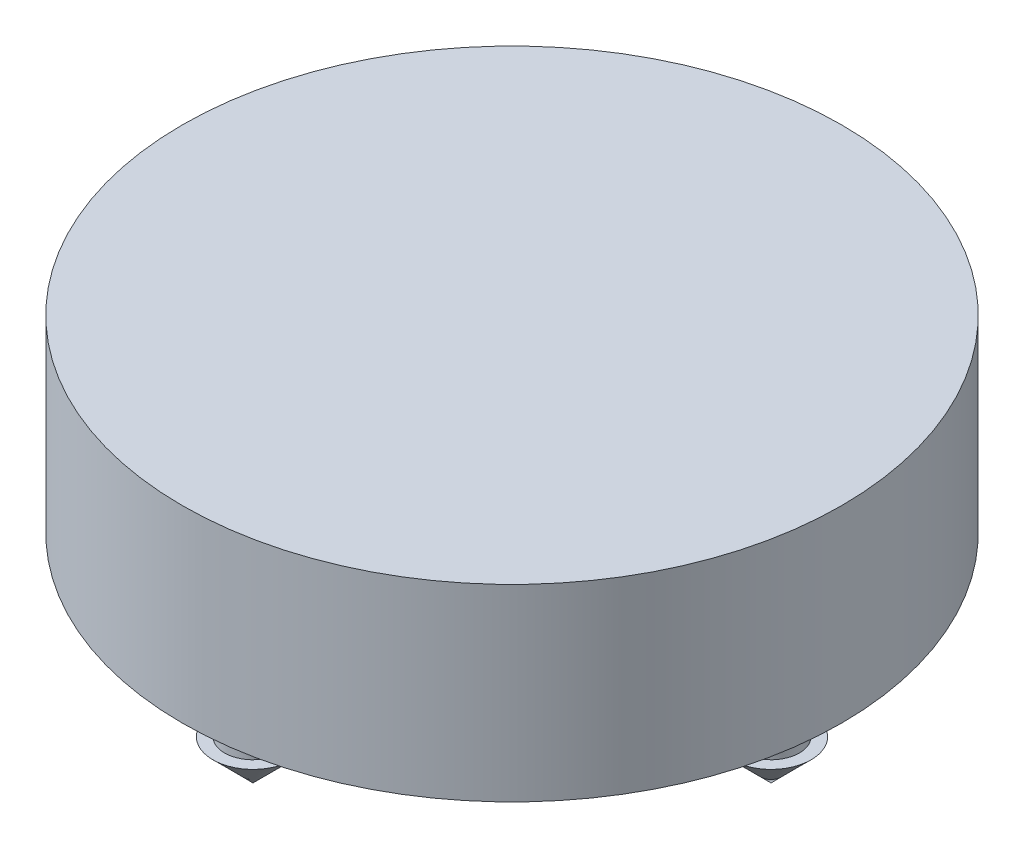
ISO-10303-21;
HEADER;
FILE_DESCRIPTION(('STEP AP214'),'2;1');
FILE_NAME('part.step','',(''),(''),'','','');
FILE_SCHEMA(('AUTOMOTIVE_DESIGN { 1 0 10303 214 1 1 1 1 }'));
ENDSEC;
DATA;
#1=APPLICATION_CONTEXT('core data for automotive mechanical design processes');
#2=APPLICATION_PROTOCOL_DEFINITION('international standard','automotive_design',2000,#1);
#3=PRODUCT_CONTEXT('',#1,'mechanical');
#4=PRODUCT('Part','Part','',(#3));
#5=PRODUCT_RELATED_PRODUCT_CATEGORY('part','',(#4));
#6=PRODUCT_DEFINITION_FORMATION('','',#4);
#7=PRODUCT_DEFINITION_CONTEXT('part definition',#1,'design');
#8=PRODUCT_DEFINITION('design','',#6,#7);
#9=PRODUCT_DEFINITION_SHAPE('','',#8);
#10=(LENGTH_UNIT() NAMED_UNIT(*) SI_UNIT(.MILLI.,.METRE.));
#11=(NAMED_UNIT(*) PLANE_ANGLE_UNIT() SI_UNIT($,.RADIAN.));
#12=(NAMED_UNIT(*) SI_UNIT($,.STERADIAN.) SOLID_ANGLE_UNIT());
#13=UNCERTAINTY_MEASURE_WITH_UNIT(LENGTH_MEASURE(1.E-05),#10,'distance_accuracy_value','');
#14=(GEOMETRIC_REPRESENTATION_CONTEXT(3) GLOBAL_UNCERTAINTY_ASSIGNED_CONTEXT((#13)) GLOBAL_UNIT_ASSIGNED_CONTEXT((#10,
#11,#12)) REPRESENTATION_CONTEXT('',''));
#15=CARTESIAN_POINT('',(0.,0.,0.));
#16=DIRECTION('',(0.,0.,1.));
#17=DIRECTION('',(1.,0.,0.));
#18=AXIS2_PLACEMENT_3D('',#15,#16,#17);
#19=CARTESIAN_POINT('',(0.,15.,0.));
#20=DIRECTION('',(0.,1.,0.));
#21=DIRECTION('',(1.,0.,0.));
#22=AXIS2_PLACEMENT_3D('',#19,#20,#21);
#23=CONICAL_SURFACE('',#22,10.,0.174532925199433);
#24=CARTESIAN_POINT('',(0.906469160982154,41.9074480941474,-14.7166185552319));
#25=CARTESIAN_POINT('',(0.906469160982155,39.8455454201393,-14.35235867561));
#26=CARTESIAN_POINT('',(0.906469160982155,37.7836509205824,-13.9880525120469));
#27=CARTESIAN_POINT('',(0.906469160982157,33.6598853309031,-13.2593146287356));
#28=CARTESIAN_POINT('',(0.906469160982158,31.5980142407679,-12.8948829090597));
#29=CARTESIAN_POINT('',(0.906469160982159,27.4743033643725,-12.1658610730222));
#30=CARTESIAN_POINT('',(0.90646916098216,25.4124635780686,-11.8012709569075));
#31=CARTESIAN_POINT('',(0.906469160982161,21.2888198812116,-11.0718811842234));
#32=CARTESIAN_POINT('',(0.906469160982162,19.2270159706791,-10.7070815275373));
#33=CARTESIAN_POINT('',(0.906469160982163,15.2028926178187,-9.99479978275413));
#34=CARTESIAN_POINT('',(0.906469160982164,13.2405708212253,-9.64733099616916));
#35=CARTESIAN_POINT('',(0.906469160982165,9.31598996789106,-8.95204237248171));
#36=CARTESIAN_POINT('',(0.906469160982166,7.35373091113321,-8.60422253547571));
#37=CARTESIAN_POINT('',(0.906469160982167,3.42930606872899,-7.90808240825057));
#38=CARTESIAN_POINT('',(0.906469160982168,1.46714028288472,-7.55976211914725));
#39=CARTESIAN_POINT('',(0.906469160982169,-2.45706127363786,-6.86237739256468));
#40=CARTESIAN_POINT('',(0.90646916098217,-4.41909704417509,-6.51331295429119));
#41=CARTESIAN_POINT('',(0.906469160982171,-7.36199860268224,-5.98881554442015));
#42=CARTESIAN_POINT('',(0.906469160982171,-8.34294452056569,-5.81383221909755));
#43=CARTESIAN_POINT('',(0.906469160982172,-10.3047653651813,-5.46346959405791));
#44=CARTESIAN_POINT('',(0.906469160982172,-11.2856402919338,-5.28809029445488));
#45=CARTESIAN_POINT('',(0.906469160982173,-13.2472920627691,-4.93680338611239));
#46=CARTESIAN_POINT('',(0.906469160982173,-14.228068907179,-4.7608957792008));
#47=CARTESIAN_POINT('',(0.906469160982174,-16.1894923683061,-4.40834966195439));
#48=CARTESIAN_POINT('',(0.906469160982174,-17.1701389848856,-4.23171115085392));
#49=CARTESIAN_POINT('',(0.906469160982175,-19.1312540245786,-3.87737726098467));
#50=CARTESIAN_POINT('',(0.906469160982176,-20.1117224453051,-3.69968186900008));
#51=CARTESIAN_POINT('',(0.906469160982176,-22.0723680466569,-3.34270401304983));
#52=CARTESIAN_POINT('',(0.906469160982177,-23.0525452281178,-3.16342155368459));
#53=CARTESIAN_POINT('',(0.906469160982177,-24.5224550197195,-2.89252624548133));
#54=CARTESIAN_POINT('',(0.906469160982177,-25.0123690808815,-2.80189855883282));
#55=CARTESIAN_POINT('',(0.906469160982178,-25.9920318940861,-2.61975749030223));
#56=CARTESIAN_POINT('',(0.906469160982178,-26.4817806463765,-2.52824410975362));
#57=CARTESIAN_POINT('',(0.906469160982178,-27.4610561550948,-2.34400712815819));
#58=CARTESIAN_POINT('',(0.906469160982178,-27.9505829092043,-2.2512835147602));
#59=CARTESIAN_POINT('',(0.906469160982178,-28.6846248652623,-2.11089309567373));
#60=CARTESIAN_POINT('',(0.906469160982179,-28.9292647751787,-2.06387866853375));
#61=CARTESIAN_POINT('',(0.906469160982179,-29.4184402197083,-1.96930804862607));
#62=CARTESIAN_POINT('',(0.906469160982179,-29.662975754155,-1.92175185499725));
#63=CARTESIAN_POINT('',(0.906469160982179,-29.9074480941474,-1.87387143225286));
#64=B_SPLINE_CURVE_WITH_KNOTS('',3,(#24,#25,#26,#27,#28,#29,#30,#31,#32,#33,#34,#35,#36,#37,#38,
#39,#40,#41,#42,#43,#44,#45,#46,#47,#48,#49,#50,#51,#52,#53,#54,#55,#56,#57,#58,#59,#60,#61,#62,
#63),.UNSPECIFIED.,.F.,.F.,(4,2,2,2,2,2,2,2,2,2,2,2,2,2,2,2,2,2,2,4),(0.,6.28149274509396,
12.5629818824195,18.8444612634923,25.1259441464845,31.1044868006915,37.0830278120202,
43.0615555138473,49.0400895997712,52.0293815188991,55.018672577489,58.0079533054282,
60.9972371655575,63.9865584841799,66.9758711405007,68.4705485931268,69.9652237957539,
71.4599142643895,72.2072632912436,72.9546135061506),.UNSPECIFIED.);
#65=CARTESIAN_POINT('',(0.906469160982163,15.,-9.95883093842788));
#66=VERTEX_POINT('',#65);
#67=CARTESIAN_POINT('',(0.90646916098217,-3.,-6.76565966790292));
#68=VERTEX_POINT('',#67);
#69=EDGE_CURVE('E204',#66,#68,#64,.T.);
#70=ORIENTED_EDGE('',*,*,#69,.F.);
#71=CARTESIAN_POINT('',(0.,15.,0.));
#72=DIRECTION('',(0.,-1.,0.));
#73=DIRECTION('',(1.,0.,0.));
#74=AXIS2_PLACEMENT_3D('',#71,#72,#73);
#75=CIRCLE('',#74,10.);
#76=CARTESIAN_POINT('',(0.906469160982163,15.,9.95883093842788));
#77=VERTEX_POINT('',#76);
#78=EDGE_CURVE('E227',#66,#77,#75,.T.);
#79=ORIENTED_EDGE('',*,*,#78,.T.);
#80=CARTESIAN_POINT('',(0.906469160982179,-29.9074480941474,1.87387143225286));
#81=CARTESIAN_POINT('',(0.906469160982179,-29.6173491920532,1.93068411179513));
#82=CARTESIAN_POINT('',(0.906469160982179,-29.3271624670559,1.98704558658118));
#83=CARTESIAN_POINT('',(0.906469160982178,-28.7466478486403,2.09903328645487));
#84=CARTESIAN_POINT('',(0.906469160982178,-28.4563199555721,2.15465951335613));
#85=CARTESIAN_POINT('',(0.906469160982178,-27.5851793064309,2.3206854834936));
#86=CARTESIAN_POINT('',(0.906469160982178,-27.0042043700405,2.43023353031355));
#87=CARTESIAN_POINT('',(0.906469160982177,-25.8419790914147,2.64783018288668));
#88=CARTESIAN_POINT('',(0.906469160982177,-25.2607287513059,2.75587880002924));
#89=CARTESIAN_POINT('',(0.906469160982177,-24.0980324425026,2.97091902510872));
#90=CARTESIAN_POINT('',(0.906469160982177,-23.5165864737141,3.07791063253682));
#91=CARTESIAN_POINT('',(0.906469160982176,-21.7720382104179,3.39774963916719));
#92=CARTESIAN_POINT('',(0.906469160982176,-20.60872775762,3.60946081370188));
#93=CARTESIAN_POINT('',(0.906469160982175,-18.2817617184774,4.03114817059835));
#94=CARTESIAN_POINT('',(0.906469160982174,-17.1181061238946,4.24112430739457));
#95=CARTESIAN_POINT('',(0.906469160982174,-14.790594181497,4.65995123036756));
#96=CARTESIAN_POINT('',(0.906469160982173,-13.6267378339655,4.86880201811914));
#97=CARTESIAN_POINT('',(0.906469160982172,-10.1979589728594,5.48295799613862));
#98=CARTESIAN_POINT('',(0.906469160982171,-7.93285126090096,5.88722865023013));
#99=CARTESIAN_POINT('',(0.90646916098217,-3.40237544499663,6.6943089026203));
#100=CARTESIAN_POINT('',(0.906469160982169,-1.13700734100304,7.09711850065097));
#101=CARTESIAN_POINT('',(0.906469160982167,3.39388885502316,7.90185277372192));
#102=CARTESIAN_POINT('',(0.906469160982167,5.65941694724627,8.3037774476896));
#103=CARTESIAN_POINT('',(0.906469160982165,10.190573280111,9.1070606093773));
#104=CARTESIAN_POINT('',(0.906469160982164,12.4562015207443,9.50841909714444));
#105=CARTESIAN_POINT('',(0.906469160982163,16.9872381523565,10.3106984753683));
#106=CARTESIAN_POINT('',(0.906469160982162,19.2526465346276,10.7116194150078));
#107=CARTESIAN_POINT('',(0.90646916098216,23.7835119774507,11.5131864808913));
#108=CARTESIAN_POINT('',(0.906469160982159,26.0489690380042,11.9138326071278));
#109=CARTESIAN_POINT('',(0.906469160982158,30.5799144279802,12.7149223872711));
#110=CARTESIAN_POINT('',(0.906469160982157,32.8454027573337,13.1153660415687));
#111=CARTESIAN_POINT('',(0.906469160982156,37.3764068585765,13.9160976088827));
#112=CARTESIAN_POINT('',(0.906469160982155,39.6419226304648,14.3163855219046));
#113=CARTESIAN_POINT('',(0.906469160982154,41.9074480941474,14.7166185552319));
#114=B_SPLINE_CURVE_WITH_KNOTS('',3,(#80,#81,#82,#83,#84,#85,#86,#87,#88,#89,#90,#91,#92,#93,
#94,#95,#96,#97,#98,#99,#100,#101,#102,#103,#104,#105,#106,#107,#108,#109,#110,#111,#112,#113),
.UNSPECIFIED.,.F.,.F.,(4,2,2,2,2,2,2,2,2,2,2,2,2,2,2,2,4),(0.,0.886827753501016,
1.77365331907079,3.54728852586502,5.3209102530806,7.09453283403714,10.6417847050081,
14.1891294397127,17.7364692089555,24.6391726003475,31.5418772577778,38.4445902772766,
45.3473027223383,52.2491368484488,59.1509711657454,66.0527921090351,72.9546128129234),.UNSPECIFIED.);
#115=CARTESIAN_POINT('',(0.90646916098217,-3.,6.76565966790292));
#116=VERTEX_POINT('',#115);
#117=EDGE_CURVE('E198',#116,#77,#114,.T.);
#118=ORIENTED_EDGE('',*,*,#117,.F.);
#119=CARTESIAN_POINT('',(0.,-3.,0.));
#120=DIRECTION('',(0.,-1.,0.));
#121=DIRECTION('',(1.,0.,0.));
#122=AXIS2_PLACEMENT_3D('',#119,#120,#121);
#123=CIRCLE('',#122,6.82611434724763);
#124=EDGE_CURVE('E231',#68,#116,#123,.T.);
#125=ORIENTED_EDGE('',*,*,#124,.F.);
#126=EDGE_LOOP('',(#70,#79,#118,#125));
#127=FACE_BOUND('',#126,.T.);
#128=ADVANCED_FACE('F39',(#127),#23,.T.);
#129=CARTESIAN_POINT('',(-0.906469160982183,41.9074480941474,14.7166185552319));
#130=CARTESIAN_POINT('',(-0.906469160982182,39.8455454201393,14.35235867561));
#131=CARTESIAN_POINT('',(-0.906469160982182,37.7836509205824,13.9880525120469));
#132=CARTESIAN_POINT('',(-0.90646916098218,33.6598853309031,13.2593146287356));
#133=CARTESIAN_POINT('',(-0.906469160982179,31.5980142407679,12.8948829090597));
#134=CARTESIAN_POINT('',(-0.906469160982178,27.4743033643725,12.1658610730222));
#135=CARTESIAN_POINT('',(-0.906469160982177,25.4124635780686,11.8012709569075));
#136=CARTESIAN_POINT('',(-0.906469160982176,21.2888198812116,11.0718811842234));
#137=CARTESIAN_POINT('',(-0.906469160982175,19.2270159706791,10.7070815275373));
#138=CARTESIAN_POINT('',(-0.906469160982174,15.2028926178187,9.99479978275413));
#139=CARTESIAN_POINT('',(-0.906469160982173,13.2405708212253,9.64733099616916));
#140=CARTESIAN_POINT('',(-0.906469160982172,9.31598996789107,8.95204237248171));
#141=CARTESIAN_POINT('',(-0.906469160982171,7.35373091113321,8.60422253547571));
#142=CARTESIAN_POINT('',(-0.90646916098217,3.42930606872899,7.90808240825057));
#143=CARTESIAN_POINT('',(-0.906469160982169,1.46714028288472,7.55976211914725));
#144=CARTESIAN_POINT('',(-0.906469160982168,-2.45706127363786,6.86237739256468));
#145=CARTESIAN_POINT('',(-0.906469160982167,-4.41909704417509,6.51331295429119));
#146=CARTESIAN_POINT('',(-0.906469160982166,-7.36199860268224,5.98881554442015));
#147=CARTESIAN_POINT('',(-0.906469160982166,-8.34294452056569,5.81383221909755));
#148=CARTESIAN_POINT('',(-0.906469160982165,-10.3047653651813,5.46346959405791));
#149=CARTESIAN_POINT('',(-0.906469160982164,-11.2856402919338,5.28809029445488));
#150=CARTESIAN_POINT('',(-0.906469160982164,-13.2472920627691,4.93680338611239));
#151=CARTESIAN_POINT('',(-0.906469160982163,-14.228068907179,4.7608957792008));
#152=CARTESIAN_POINT('',(-0.906469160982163,-16.1894923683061,4.40834966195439));
#153=CARTESIAN_POINT('',(-0.906469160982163,-17.1701389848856,4.23171115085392));
#154=CARTESIAN_POINT('',(-0.906469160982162,-19.1312540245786,3.87737726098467));
#155=CARTESIAN_POINT('',(-0.906469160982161,-20.1117224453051,3.69968186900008));
#156=CARTESIAN_POINT('',(-0.906469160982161,-22.0723680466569,3.34270401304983));
#157=CARTESIAN_POINT('',(-0.90646916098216,-23.0525452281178,3.16342155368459));
#158=CARTESIAN_POINT('',(-0.90646916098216,-24.5224550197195,2.89252624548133));
#159=CARTESIAN_POINT('',(-0.90646916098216,-25.0123690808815,2.80189855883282));
#160=CARTESIAN_POINT('',(-0.906469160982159,-25.9920318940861,2.61975749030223));
#161=CARTESIAN_POINT('',(-0.906469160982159,-26.4817806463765,2.52824410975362));
#162=CARTESIAN_POINT('',(-0.906469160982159,-27.4610561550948,2.34400712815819));
#163=CARTESIAN_POINT('',(-0.906469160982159,-27.9505829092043,2.2512835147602));
#164=CARTESIAN_POINT('',(-0.906469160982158,-28.6846248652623,2.11089309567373));
#165=CARTESIAN_POINT('',(-0.906469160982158,-28.9292647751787,2.06387866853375));
#166=CARTESIAN_POINT('',(-0.906469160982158,-29.4184402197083,1.96930804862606));
#167=CARTESIAN_POINT('',(-0.906469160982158,-29.662975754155,1.92175185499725));
#168=CARTESIAN_POINT('',(-0.906469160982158,-29.9074480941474,1.87387143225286));
#169=B_SPLINE_CURVE_WITH_KNOTS('',3,(#129,#130,#131,#132,#133,#134,#135,#136,#137,#138,#139,
#140,#141,#142,#143,#144,#145,#146,#147,#148,#149,#150,#151,#152,#153,#154,#155,#156,#157,#158,
#159,#160,#161,#162,#163,#164,#165,#166,#167,#168),.UNSPECIFIED.,.F.,.F.,(4,2,2,2,2,2,2,2,2,2,2,
2,2,2,2,2,2,2,2,4),(0.,6.28149274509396,12.5629818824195,18.8444612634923,25.1259441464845,
31.1044868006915,37.0830278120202,43.0615555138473,49.0400895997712,52.0293815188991,
55.018672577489,58.0079533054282,60.9972371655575,63.9865584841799,66.9758711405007,
68.4705485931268,69.965223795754,71.4599142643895,72.2072632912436,72.9546135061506),.UNSPECIFIED.);
#170=CARTESIAN_POINT('',(-0.906469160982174,15.,9.95883093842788));
#171=VERTEX_POINT('',#170);
#172=CARTESIAN_POINT('',(-0.906469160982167,-3.,6.76565966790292));
#173=VERTEX_POINT('',#172);
#174=EDGE_CURVE('E54',#171,#173,#169,.T.);
#175=ORIENTED_EDGE('',*,*,#174,.F.);
#176=CARTESIAN_POINT('',(-0.906469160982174,15.,-9.95883093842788));
#177=VERTEX_POINT('',#176);
#178=EDGE_CURVE('E230',#171,#177,#75,.T.);
#179=ORIENTED_EDGE('',*,*,#178,.T.);
#180=CARTESIAN_POINT('',(-0.906469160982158,-29.9074480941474,-1.87387143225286));
#181=CARTESIAN_POINT('',(-0.906469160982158,-29.6173491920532,-1.93068411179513));
#182=CARTESIAN_POINT('',(-0.906469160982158,-29.3271624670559,-1.98704558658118));
#183=CARTESIAN_POINT('',(-0.906469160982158,-28.7466478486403,-2.09903328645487));
#184=CARTESIAN_POINT('',(-0.906469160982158,-28.4563199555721,-2.15465951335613));
#185=CARTESIAN_POINT('',(-0.906469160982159,-27.5851793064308,-2.3206854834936));
#186=CARTESIAN_POINT('',(-0.906469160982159,-27.0042043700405,-2.43023353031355));
#187=CARTESIAN_POINT('',(-0.906469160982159,-25.8419790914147,-2.64783018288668));
#188=CARTESIAN_POINT('',(-0.90646916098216,-25.2607287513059,-2.75587880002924));
#189=CARTESIAN_POINT('',(-0.90646916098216,-24.0980324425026,-2.97091902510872));
#190=CARTESIAN_POINT('',(-0.90646916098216,-23.5165864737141,-3.07791063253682));
#191=CARTESIAN_POINT('',(-0.906469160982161,-21.7720382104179,-3.39774963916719));
#192=CARTESIAN_POINT('',(-0.906469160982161,-20.60872775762,-3.60946081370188));
#193=CARTESIAN_POINT('',(-0.906469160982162,-18.2817617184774,-4.03114817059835));
#194=CARTESIAN_POINT('',(-0.906469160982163,-17.1181061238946,-4.24112430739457));
#195=CARTESIAN_POINT('',(-0.906469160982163,-14.790594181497,-4.65995123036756));
#196=CARTESIAN_POINT('',(-0.906469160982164,-13.6267378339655,-4.86880201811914));
#197=CARTESIAN_POINT('',(-0.906469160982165,-10.1979589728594,-5.48295799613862));
#198=CARTESIAN_POINT('',(-0.906469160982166,-7.93285126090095,-5.88722865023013));
#199=CARTESIAN_POINT('',(-0.906469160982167,-3.40237544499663,-6.69430890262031));
#200=CARTESIAN_POINT('',(-0.906469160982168,-1.13700734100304,-7.09711850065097));
#201=CARTESIAN_POINT('',(-0.90646916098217,3.39388885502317,-7.90185277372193));
#202=CARTESIAN_POINT('',(-0.90646916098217,5.65941694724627,-8.3037774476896));
#203=CARTESIAN_POINT('',(-0.906469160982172,10.190573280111,-9.1070606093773));
#204=CARTESIAN_POINT('',(-0.906469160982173,12.4562015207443,-9.50841909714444));
#205=CARTESIAN_POINT('',(-0.906469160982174,16.9872381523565,-10.3106984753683));
#206=CARTESIAN_POINT('',(-0.906469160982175,19.2526465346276,-10.7116194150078));
#207=CARTESIAN_POINT('',(-0.906469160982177,23.7835119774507,-11.5131864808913));
#208=CARTESIAN_POINT('',(-0.906469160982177,26.0489690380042,-11.9138326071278));
#209=CARTESIAN_POINT('',(-0.906469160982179,30.5799144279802,-12.714922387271));
#210=CARTESIAN_POINT('',(-0.90646916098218,32.8454027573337,-13.1153660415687));
#211=CARTESIAN_POINT('',(-0.906469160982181,37.3764068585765,-13.9160976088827));
#212=CARTESIAN_POINT('',(-0.906469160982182,39.6419226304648,-14.3163855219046));
#213=CARTESIAN_POINT('',(-0.906469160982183,41.9074480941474,-14.7166185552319));
#214=B_SPLINE_CURVE_WITH_KNOTS('',3,(#180,#181,#182,#183,#184,#185,#186,#187,#188,#189,#190,
#191,#192,#193,#194,#195,#196,#197,#198,#199,#200,#201,#202,#203,#204,#205,#206,#207,#208,#209,
#210,#211,#212,#213),.UNSPECIFIED.,.F.,.F.,(4,2,2,2,2,2,2,2,2,2,2,2,2,2,2,2,4),(0.,
0.886827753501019,1.7736533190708,3.54728852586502,5.3209102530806,7.09453283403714,
10.6417847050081,14.1891294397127,17.7364692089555,24.6391726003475,31.5418772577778,
38.4445902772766,45.3473027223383,52.2491368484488,59.1509711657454,66.052792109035,
72.9546128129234),.UNSPECIFIED.);
#215=CARTESIAN_POINT('',(-0.906469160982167,-3.,-6.76565966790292));
#216=VERTEX_POINT('',#215);
#217=EDGE_CURVE('E165',#216,#177,#214,.T.);
#218=ORIENTED_EDGE('',*,*,#217,.F.);
#219=EDGE_CURVE('E234',#173,#216,#123,.T.);
#220=ORIENTED_EDGE('',*,*,#219,.F.);
#221=EDGE_LOOP('',(#175,#179,#218,#220));
#222=FACE_BOUND('',#221,.T.);
#223=ADVANCED_FACE('F261',(#222),#23,.T.);
#224=CARTESIAN_POINT('',(0.,-3.,0.));
#225=DIRECTION('',(0.,-1.,0.));
#226=DIRECTION('',(1.,0.,0.));
#227=AXIS2_PLACEMENT_3D('',#224,#225,#226);
#228=PLANE('',#227);
#229=ORIENTED_EDGE('',*,*,#124,.T.);
#230=DIRECTION('',(0.,0.,-1.));
#231=VECTOR('',#230,1.);
#232=CARTESIAN_POINT('',(0.90646916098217,-3.,0.));
#233=LINE('',#232,#231);
#234=EDGE_CURVE('E11',#116,#68,#233,.T.);
#235=ORIENTED_EDGE('',*,*,#234,.T.);
#236=EDGE_LOOP('',(#229,#235));
#237=FACE_BOUND('',#236,.T.);
#238=ADVANCED_FACE('F290',(#237),#228,.T.);
#239=ORIENTED_EDGE('',*,*,#219,.T.);
#240=DIRECTION('',(0.,0.,1.));
#241=VECTOR('',#240,1.);
#242=CARTESIAN_POINT('',(-0.906469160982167,-3.,0.));
#243=LINE('',#242,#241);
#244=EDGE_CURVE('E47',#216,#173,#243,.T.);
#245=ORIENTED_EDGE('',*,*,#244,.T.);
#246=EDGE_LOOP('',(#239,#245));
#247=FACE_BOUND('',#246,.T.);
#248=ADVANCED_FACE('F258',(#247),#228,.T.);
#249=CARTESIAN_POINT('',(0.,20.,0.));
#250=DIRECTION('',(0.,1.,0.));
#251=DIRECTION('',(-1.,0.,0.));
#252=AXIS2_PLACEMENT_3D('',#249,#250,#251);
#253=PLANE('',#252);
#254=CARTESIAN_POINT('',(0.,20.,0.));
#255=DIRECTION('',(0.,-1.,0.));
#256=DIRECTION('',(1.,0.,0.));
#257=AXIS2_PLACEMENT_3D('',#254,#255,#256);
#258=CIRCLE('',#257,35.);
#259=CARTESIAN_POINT('',(35.,20.,0.));
#260=VERTEX_POINT('',#259);
#261=EDGE_CURVE('E244',#260,#260,#258,.T.);
#262=ORIENTED_EDGE('',*,*,#261,.F.);
#263=EDGE_LOOP('',(#262));
#264=FACE_BOUND('',#263,.T.);
#265=ADVANCED_FACE('F41',(#264),#253,.T.);
#266=CARTESIAN_POINT('',(0.,0.,0.));
#267=DIRECTION('',(0.,-1.,0.));
#268=DIRECTION('',(1.,0.,0.));
#269=AXIS2_PLACEMENT_3D('',#266,#267,#268);
#270=CYLINDRICAL_SURFACE('',#269,35.);
#271=DIRECTION('',(0.,-1.,0.));
#272=VECTOR('',#271,1.);
#273=CARTESIAN_POINT('',(3.5,0.,-34.8245602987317));
#274=LINE('',#273,#272);
#275=CARTESIAN_POINT('',(3.5,12.6432003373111,-34.8245602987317));
#276=VERTEX_POINT('',#275);
#277=CARTESIAN_POINT('',(3.5,8.64320033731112,-34.8245602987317));
#278=VERTEX_POINT('',#277);
#279=EDGE_CURVE('E225',#276,#278,#274,.T.);
#280=ORIENTED_EDGE('',*,*,#279,.F.);
#281=CARTESIAN_POINT('',(0.,12.6432003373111,0.));
#282=DIRECTION('',(0.,1.,0.));
#283=DIRECTION('',(0.,0.,1.));
#284=AXIS2_PLACEMENT_3D('',#281,#282,#283);
#285=CIRCLE('',#284,35.);
#286=CARTESIAN_POINT('',(-3.5,12.6432003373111,-34.8245602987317));
#287=VERTEX_POINT('',#286);
#288=EDGE_CURVE('E214',#287,#276,#285,.F.);
#289=ORIENTED_EDGE('',*,*,#288,.F.);
#290=DIRECTION('',(0.,-1.,0.));
#291=VECTOR('',#290,1.);
#292=CARTESIAN_POINT('',(-3.5,0.,-34.8245602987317));
#293=LINE('',#292,#291);
#294=CARTESIAN_POINT('',(-3.5,8.64320033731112,-34.8245602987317));
#295=VERTEX_POINT('',#294);
#296=EDGE_CURVE('E221',#295,#287,#293,.F.);
#297=ORIENTED_EDGE('',*,*,#296,.F.);
#298=CARTESIAN_POINT('',(0.,8.64320033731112,0.));
#299=DIRECTION('',(0.,-1.,0.));
#300=DIRECTION('',(0.,0.,-1.));
#301=AXIS2_PLACEMENT_3D('',#298,#299,#300);
#302=CIRCLE('',#301,35.);
#303=EDGE_CURVE('E223',#278,#295,#302,.F.);
#304=ORIENTED_EDGE('',*,*,#303,.F.);
#305=EDGE_LOOP('',(#280,#289,#297,#304));
#306=FACE_BOUND('',#305,.T.);
#307=ORIENTED_EDGE('',*,*,#261,.T.);
#308=EDGE_LOOP('',(#307));
#309=FACE_BOUND('',#308,.T.);
#310=CARTESIAN_POINT('',(0.,0.,0.));
#311=DIRECTION('',(0.,-1.,0.));
#312=DIRECTION('',(1.,0.,0.));
#313=AXIS2_PLACEMENT_3D('',#310,#311,#312);
#314=CIRCLE('',#313,35.);
#315=CARTESIAN_POINT('',(35.,0.,0.));
#316=VERTEX_POINT('',#315);
#317=EDGE_CURVE('E241',#316,#316,#314,.T.);
#318=ORIENTED_EDGE('',*,*,#317,.F.);
#319=EDGE_LOOP('',(#318));
#320=FACE_BOUND('',#319,.T.);
#321=ADVANCED_FACE('F280',(#306,#309,#320),#270,.T.);
#322=CARTESIAN_POINT('',(35.,0.,0.));
#323=DIRECTION('',(0.,-1.,0.));
#324=DIRECTION('',(1.,0.,0.));
#325=AXIS2_PLACEMENT_3D('',#322,#323,#324);
#326=PLANE('',#325);
#327=CARTESIAN_POINT('',(2.88047210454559E-13,0.,-27.5));
#328=DIRECTION('',(0.,-1.,0.));
#329=DIRECTION('',(0.,0.,-1.));
#330=AXIS2_PLACEMENT_3D('',#327,#328,#329);
#331=CIRCLE('',#330,3.);
#332=CARTESIAN_POINT('',(3.19470542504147E-13,0.,-30.5));
#333=VERTEX_POINT('',#332);
#334=EDGE_CURVE('E135',#333,#333,#331,.T.);
#335=ORIENTED_EDGE('',*,*,#334,.F.);
#336=EDGE_LOOP('',(#335));
#337=FACE_BOUND('',#336,.T.);
#338=CARTESIAN_POINT('',(-27.5,0.,0.));
#339=DIRECTION('',(0.,-1.,0.));
#340=DIRECTION('',(-1.,0.,0.));
#341=AXIS2_PLACEMENT_3D('',#338,#339,#340);
#342=CIRCLE('',#341,3.);
#343=CARTESIAN_POINT('',(-30.5,0.,0.));
#344=VERTEX_POINT('',#343);
#345=EDGE_CURVE('E139',#344,#344,#342,.T.);
#346=ORIENTED_EDGE('',*,*,#345,.F.);
#347=EDGE_LOOP('',(#346));
#348=FACE_BOUND('',#347,.T.);
#349=CARTESIAN_POINT('',(0.,0.,27.5));
#350=DIRECTION('',(0.,-1.,0.));
#351=DIRECTION('',(0.,0.,1.));
#352=AXIS2_PLACEMENT_3D('',#349,#350,#351);
#353=CIRCLE('',#352,3.);
#354=CARTESIAN_POINT('',(-1.06490180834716E-13,0.,30.5));
#355=VERTEX_POINT('',#354);
#356=EDGE_CURVE('E145',#355,#355,#353,.T.);
#357=ORIENTED_EDGE('',*,*,#356,.F.);
#358=EDGE_LOOP('',(#357));
#359=FACE_BOUND('',#358,.T.);
#360=CARTESIAN_POINT('',(27.5,0.,0.));
#361=DIRECTION('',(0.,-1.,0.));
#362=DIRECTION('',(1.,0.,0.));
#363=AXIS2_PLACEMENT_3D('',#360,#361,#362);
#364=CIRCLE('',#363,3.);
#365=CARTESIAN_POINT('',(30.5,0.,0.));
#366=VERTEX_POINT('',#365);
#367=EDGE_CURVE('E151',#366,#366,#364,.T.);
#368=ORIENTED_EDGE('',*,*,#367,.F.);
#369=EDGE_LOOP('',(#368));
#370=FACE_BOUND('',#369,.T.);
#371=ORIENTED_EDGE('',*,*,#317,.T.);
#372=EDGE_LOOP('',(#371));
#373=FACE_BOUND('',#372,.T.);
#374=CARTESIAN_POINT('',(0.,0.,0.));
#375=DIRECTION('',(0.,-1.,0.));
#376=DIRECTION('',(1.,0.,0.));
#377=AXIS2_PLACEMENT_3D('',#374,#375,#376);
#378=CIRCLE('',#377,20.);
#379=CARTESIAN_POINT('',(20.,0.,0.));
#380=VERTEX_POINT('',#379);
#381=EDGE_CURVE('E238',#380,#380,#378,.T.);
#382=ORIENTED_EDGE('',*,*,#381,.F.);
#383=EDGE_LOOP('',(#382));
#384=FACE_BOUND('',#383,.T.);
#385=ADVANCED_FACE('F274',(#337,#348,#359,#370,#373,#384),#326,.T.);
#386=CARTESIAN_POINT('',(0.,0.,0.));
#387=DIRECTION('',(0.,-1.,0.));
#388=DIRECTION('',(1.,0.,0.));
#389=AXIS2_PLACEMENT_3D('',#386,#387,#388);
#390=CYLINDRICAL_SURFACE('',#389,20.);
#391=DIRECTION('',(0.,-1.,0.));
#392=VECTOR('',#391,1.);
#393=CARTESIAN_POINT('',(3.5,0.,-19.6913686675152));
#394=LINE('',#393,#392);
#395=CARTESIAN_POINT('',(3.5,8.64320033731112,-19.6913686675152));
#396=VERTEX_POINT('',#395);
#397=CARTESIAN_POINT('',(3.5,12.6432003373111,-19.6913686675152));
#398=VERTEX_POINT('',#397);
#399=EDGE_CURVE('E253',#396,#398,#394,.F.);
#400=ORIENTED_EDGE('',*,*,#399,.F.);
#401=CARTESIAN_POINT('',(0.,8.64320033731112,0.));
#402=DIRECTION('',(0.,-1.,0.));
#403=DIRECTION('',(0.,0.,-1.));
#404=AXIS2_PLACEMENT_3D('',#401,#402,#403);
#405=CIRCLE('',#404,20.);
#406=CARTESIAN_POINT('',(-3.5,8.64320033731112,-19.6913686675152));
#407=VERTEX_POINT('',#406);
#408=EDGE_CURVE('E251',#407,#396,#405,.T.);
#409=ORIENTED_EDGE('',*,*,#408,.F.);
#410=DIRECTION('',(0.,-1.,0.));
#411=VECTOR('',#410,1.);
#412=CARTESIAN_POINT('',(-3.5,0.,-19.6913686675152));
#413=LINE('',#412,#411);
#414=CARTESIAN_POINT('',(-3.5,12.6432003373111,-19.6913686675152));
#415=VERTEX_POINT('',#414);
#416=EDGE_CURVE('E249',#415,#407,#413,.T.);
#417=ORIENTED_EDGE('',*,*,#416,.F.);
#418=CARTESIAN_POINT('',(0.,12.6432003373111,0.));
#419=DIRECTION('',(0.,1.,0.));
#420=DIRECTION('',(0.,0.,1.));
#421=AXIS2_PLACEMENT_3D('',#418,#419,#420);
#422=CIRCLE('',#421,20.);
#423=EDGE_CURVE('E247',#398,#415,#422,.T.);
#424=ORIENTED_EDGE('',*,*,#423,.F.);
#425=EDGE_LOOP('',(#400,#409,#417,#424));
#426=FACE_BOUND('',#425,.T.);
#427=ORIENTED_EDGE('',*,*,#381,.T.);
#428=EDGE_LOOP('',(#427));
#429=FACE_BOUND('',#428,.T.);
#430=CARTESIAN_POINT('',(0.,15.,0.));
#431=DIRECTION('',(0.,-1.,0.));
#432=DIRECTION('',(1.,0.,0.));
#433=AXIS2_PLACEMENT_3D('',#430,#431,#432);
#434=CIRCLE('',#433,20.);
#435=CARTESIAN_POINT('',(20.,15.,0.));
#436=VERTEX_POINT('',#435);
#437=EDGE_CURVE('E235',#436,#436,#434,.T.);
#438=ORIENTED_EDGE('',*,*,#437,.F.);
#439=EDGE_LOOP('',(#438));
#440=FACE_BOUND('',#439,.T.);
#441=ADVANCED_FACE('F269',(#426,#429,#440),#390,.F.);
#442=CARTESIAN_POINT('',(20.,15.,0.));
#443=DIRECTION('',(0.,-1.,0.));
#444=DIRECTION('',(1.,0.,0.));
#445=AXIS2_PLACEMENT_3D('',#442,#443,#444);
#446=PLANE('',#445);
#447=DIRECTION('',(0.,0.,1.));
#448=VECTOR('',#447,1.);
#449=CARTESIAN_POINT('',(0.906469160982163,15.,16.5604942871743));
#450=LINE('',#449,#448);
#451=EDGE_CURVE('E157',#66,#77,#450,.T.);
#452=ORIENTED_EDGE('',*,*,#451,.T.);
#453=ORIENTED_EDGE('',*,*,#78,.F.);
#454=EDGE_LOOP('',(#452,#453));
#455=FACE_BOUND('',#454,.T.);
#456=DIRECTION('',(0.,0.,-1.));
#457=VECTOR('',#456,1.);
#458=CARTESIAN_POINT('',(-0.906469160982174,15.,16.5604942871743));
#459=LINE('',#458,#457);
#460=EDGE_CURVE('E162',#171,#177,#459,.T.);
#461=ORIENTED_EDGE('',*,*,#460,.T.);
#462=ORIENTED_EDGE('',*,*,#178,.F.);
#463=EDGE_LOOP('',(#461,#462));
#464=FACE_BOUND('',#463,.T.);
#465=ORIENTED_EDGE('',*,*,#437,.T.);
#466=EDGE_LOOP('',(#465));
#467=FACE_BOUND('',#466,.T.);
#468=ADVANCED_FACE('F265',(#455,#464,#467),#446,.T.);
#469=CARTESIAN_POINT('',(3.5,12.6432003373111,-46.));
#470=DIRECTION('',(1.,0.,0.));
#471=DIRECTION('',(0.,0.,-1.));
#472=AXIS2_PLACEMENT_3D('',#469,#470,#471);
#473=PLANE('',#472);
#474=ORIENTED_EDGE('',*,*,#279,.T.);
#475=DIRECTION('',(0.,0.,1.));
#476=VECTOR('',#475,1.);
#477=CARTESIAN_POINT('',(3.5,8.64320033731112,-46.));
#478=LINE('',#477,#476);
#479=EDGE_CURVE('E211',#278,#396,#478,.T.);
#480=ORIENTED_EDGE('',*,*,#479,.T.);
#481=ORIENTED_EDGE('',*,*,#399,.T.);
#482=DIRECTION('',(0.,0.,1.));
#483=VECTOR('',#482,1.);
#484=CARTESIAN_POINT('',(3.5,12.6432003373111,-46.));
#485=LINE('',#484,#483);
#486=EDGE_CURVE('E210',#276,#398,#485,.T.);
#487=ORIENTED_EDGE('',*,*,#486,.F.);
#488=EDGE_LOOP('',(#474,#480,#481,#487));
#489=FACE_BOUND('',#488,.T.);
#490=ADVANCED_FACE('F268',(#489),#473,.F.);
#491=CARTESIAN_POINT('',(-3.5,8.64320033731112,-46.));
#492=DIRECTION('',(0.,-1.,0.));
#493=DIRECTION('',(0.,0.,-1.));
#494=AXIS2_PLACEMENT_3D('',#491,#492,#493);
#495=PLANE('',#494);
#496=ORIENTED_EDGE('',*,*,#303,.T.);
#497=DIRECTION('',(0.,0.,1.));
#498=VECTOR('',#497,1.);
#499=CARTESIAN_POINT('',(-3.5,8.64320033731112,-46.));
#500=LINE('',#499,#498);
#501=EDGE_CURVE('E215',#295,#407,#500,.T.);
#502=ORIENTED_EDGE('',*,*,#501,.T.);
#503=ORIENTED_EDGE('',*,*,#408,.T.);
#504=ORIENTED_EDGE('',*,*,#479,.F.);
#505=EDGE_LOOP('',(#496,#502,#503,#504));
#506=FACE_BOUND('',#505,.T.);
#507=ADVANCED_FACE('F195',(#506),#495,.F.);
#508=CARTESIAN_POINT('',(-3.5,12.6432003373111,-46.));
#509=DIRECTION('',(-1.,0.,0.));
#510=DIRECTION('',(0.,-1.,0.));
#511=AXIS2_PLACEMENT_3D('',#508,#509,#510);
#512=PLANE('',#511);
#513=ORIENTED_EDGE('',*,*,#296,.T.);
#514=DIRECTION('',(0.,0.,1.));
#515=VECTOR('',#514,1.);
#516=CARTESIAN_POINT('',(-3.5,12.6432003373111,-46.));
#517=LINE('',#516,#515);
#518=EDGE_CURVE('E62',#287,#415,#517,.T.);
#519=ORIENTED_EDGE('',*,*,#518,.T.);
#520=ORIENTED_EDGE('',*,*,#416,.T.);
#521=ORIENTED_EDGE('',*,*,#501,.F.);
#522=EDGE_LOOP('',(#513,#519,#520,#521));
#523=FACE_BOUND('',#522,.T.);
#524=ADVANCED_FACE('F305',(#523),#512,.F.);
#525=CARTESIAN_POINT('',(-3.5,12.6432003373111,-46.));
#526=DIRECTION('',(0.,1.,0.));
#527=DIRECTION('',(0.,0.,1.));
#528=AXIS2_PLACEMENT_3D('',#525,#526,#527);
#529=PLANE('',#528);
#530=ORIENTED_EDGE('',*,*,#288,.T.);
#531=ORIENTED_EDGE('',*,*,#486,.T.);
#532=ORIENTED_EDGE('',*,*,#423,.T.);
#533=ORIENTED_EDGE('',*,*,#518,.F.);
#534=EDGE_LOOP('',(#530,#531,#532,#533));
#535=FACE_BOUND('',#534,.T.);
#536=ADVANCED_FACE('F193',(#535),#529,.F.);
#537=CARTESIAN_POINT('',(0.90646916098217,-3.,16.5604942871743));
#538=DIRECTION('',(-1.,0.,0.));
#539=DIRECTION('',(0.,-1.,0.));
#540=AXIS2_PLACEMENT_3D('',#537,#538,#539);
#541=PLANE('',#540);
#542=ORIENTED_EDGE('',*,*,#69,.T.);
#543=ORIENTED_EDGE('',*,*,#234,.F.);
#544=ORIENTED_EDGE('',*,*,#117,.T.);
#545=ORIENTED_EDGE('',*,*,#451,.F.);
#546=EDGE_LOOP('',(#542,#543,#544,#545));
#547=FACE_BOUND('',#546,.T.);
#548=ADVANCED_FACE('F187',(#547),#541,.T.);
#549=CARTESIAN_POINT('',(-0.906469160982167,-3.,16.5604942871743));
#550=DIRECTION('',(1.,0.,0.));
#551=DIRECTION('',(0.,1.,0.));
#552=AXIS2_PLACEMENT_3D('',#549,#550,#551);
#553=PLANE('',#552);
#554=ORIENTED_EDGE('',*,*,#174,.T.);
#555=ORIENTED_EDGE('',*,*,#244,.F.);
#556=ORIENTED_EDGE('',*,*,#217,.T.);
#557=ORIENTED_EDGE('',*,*,#460,.F.);
#558=EDGE_LOOP('',(#554,#555,#556,#557));
#559=FACE_BOUND('',#558,.T.);
#560=ADVANCED_FACE('F181',(#559),#553,.T.);
#561=CARTESIAN_POINT('',(27.5,-4.99999999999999,0.));
#562=DIRECTION('',(0.,1.,0.));
#563=DIRECTION('',(-1.,0.,0.));
#564=AXIS2_PLACEMENT_3D('',#561,#562,#563);
#565=CYLINDRICAL_SURFACE('',#564,3.);
#566=CARTESIAN_POINT('',(27.5,-4.99999999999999,0.));
#567=DIRECTION('',(0.,-1.,0.));
#568=DIRECTION('',(1.,0.,0.));
#569=AXIS2_PLACEMENT_3D('',#566,#567,#568);
#570=CIRCLE('',#569,3.);
#571=CARTESIAN_POINT('',(30.5,-4.99999999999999,0.));
#572=VERTEX_POINT('',#571);
#573=EDGE_CURVE('E154',#572,#572,#570,.T.);
#574=ORIENTED_EDGE('',*,*,#573,.F.);
#575=EDGE_LOOP('',(#574));
#576=FACE_BOUND('',#575,.T.);
#577=ORIENTED_EDGE('',*,*,#367,.T.);
#578=EDGE_LOOP('',(#577));
#579=FACE_BOUND('',#578,.T.);
#580=ADVANCED_FACE('F186',(#576,#579),#565,.T.);
#581=CARTESIAN_POINT('',(0.,-5.,27.5));
#582=DIRECTION('',(0.,1.,0.));
#583=DIRECTION('',(-1.,0.,0.));
#584=AXIS2_PLACEMENT_3D('',#581,#582,#583);
#585=CYLINDRICAL_SURFACE('',#584,3.);
#586=CARTESIAN_POINT('',(0.,-5.,27.5));
#587=DIRECTION('',(0.,-1.,0.));
#588=DIRECTION('',(0.,0.,1.));
#589=AXIS2_PLACEMENT_3D('',#586,#587,#588);
#590=CIRCLE('',#589,3.);
#591=CARTESIAN_POINT('',(-1.04755457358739E-13,-5.,30.5));
#592=VERTEX_POINT('',#591);
#593=EDGE_CURVE('E148',#592,#592,#590,.T.);
#594=ORIENTED_EDGE('',*,*,#593,.F.);
#595=EDGE_LOOP('',(#594));
#596=FACE_BOUND('',#595,.T.);
#597=ORIENTED_EDGE('',*,*,#356,.T.);
#598=EDGE_LOOP('',(#597));
#599=FACE_BOUND('',#598,.T.);
#600=ADVANCED_FACE('F357',(#596,#599),#585,.T.);
#601=CARTESIAN_POINT('',(-27.5,-5.00000000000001,0.));
#602=DIRECTION('',(0.,1.,0.));
#603=DIRECTION('',(-1.,0.,0.));
#604=AXIS2_PLACEMENT_3D('',#601,#602,#603);
#605=CYLINDRICAL_SURFACE('',#604,3.);
#606=CARTESIAN_POINT('',(-27.5,-5.00000000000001,0.));
#607=DIRECTION('',(0.,-1.,0.));
#608=DIRECTION('',(-1.,0.,0.));
#609=AXIS2_PLACEMENT_3D('',#606,#607,#608);
#610=CIRCLE('',#609,3.);
#611=CARTESIAN_POINT('',(-30.5,-5.00000000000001,0.));
#612=VERTEX_POINT('',#611);
#613=EDGE_CURVE('E142',#612,#612,#610,.T.);
#614=ORIENTED_EDGE('',*,*,#613,.F.);
#615=EDGE_LOOP('',(#614));
#616=FACE_BOUND('',#615,.T.);
#617=ORIENTED_EDGE('',*,*,#345,.T.);
#618=EDGE_LOOP('',(#617));
#619=FACE_BOUND('',#618,.T.);
#620=ADVANCED_FACE('F362',(#616,#619),#605,.T.);
#621=CARTESIAN_POINT('',(2.89781933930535E-13,-5.,-27.5));
#622=DIRECTION('',(0.,1.,0.));
#623=DIRECTION('',(-1.,0.,0.));
#624=AXIS2_PLACEMENT_3D('',#621,#622,#623);
#625=CYLINDRICAL_SURFACE('',#624,3.);
#626=CARTESIAN_POINT('',(2.89781933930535E-13,-5.,-27.5));
#627=DIRECTION('',(0.,-1.,0.));
#628=DIRECTION('',(0.,0.,-1.));
#629=AXIS2_PLACEMENT_3D('',#626,#627,#628);
#630=CIRCLE('',#629,3.);
#631=CARTESIAN_POINT('',(3.21205265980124E-13,-5.,-30.5));
#632=VERTEX_POINT('',#631);
#633=EDGE_CURVE('E136',#632,#632,#630,.T.);
#634=ORIENTED_EDGE('',*,*,#633,.F.);
#635=EDGE_LOOP('',(#634));
#636=FACE_BOUND('',#635,.T.);
#637=ORIENTED_EDGE('',*,*,#334,.T.);
#638=EDGE_LOOP('',(#637));
#639=FACE_BOUND('',#638,.T.);
#640=ADVANCED_FACE('F372',(#636,#639),#625,.T.);
#641=CARTESIAN_POINT('',(0.,-5.,27.5));
#642=DIRECTION('',(0.,1.,0.));
#643=DIRECTION('',(1.,0.,0.));
#644=AXIS2_PLACEMENT_3D('',#641,#642,#643);
#645=CONICAL_SURFACE('',#644,4.25,0.78539816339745);
#646=CARTESIAN_POINT('',(0.,-9.24999999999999,27.5));
#647=VERTEX_POINT('',#646);
#648=VERTEX_LOOP('',#647);
#649=FACE_BOUND('',#648,.T.);
#650=CARTESIAN_POINT('',(0.,-5.,27.5));
#651=DIRECTION('',(0.,-1.,0.));
#652=DIRECTION('',(1.,0.,0.));
#653=AXIS2_PLACEMENT_3D('',#650,#651,#652);
#654=CIRCLE('',#653,4.25);
#655=CARTESIAN_POINT('',(4.24999999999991,-5.,27.5));
#656=VERTEX_POINT('',#655);
#657=EDGE_CURVE('E132',#656,#656,#654,.T.);
#658=ORIENTED_EDGE('',*,*,#657,.T.);
#659=EDGE_LOOP('',(#658));
#660=FACE_BOUND('',#659,.T.);
#661=ADVANCED_FACE('F383',(#649,#660),#645,.T.);
#662=CARTESIAN_POINT('',(0.,-5.,27.5));
#663=DIRECTION('',(0.,-1.,0.));
#664=DIRECTION('',(1.,0.,0.));
#665=AXIS2_PLACEMENT_3D('',#662,#663,#664);
#666=PLANE('',#665);
#667=ORIENTED_EDGE('',*,*,#593,.T.);
#668=EDGE_LOOP('',(#667));
#669=FACE_BOUND('',#668,.T.);
#670=ORIENTED_EDGE('',*,*,#657,.F.);
#671=EDGE_LOOP('',(#670));
#672=FACE_BOUND('',#671,.T.);
#673=ADVANCED_FACE('F394',(#669,#672),#666,.F.);
#674=CARTESIAN_POINT('',(-27.5,-5.00000000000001,-1.92031473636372E-13));
#675=DIRECTION('',(0.,1.,0.));
#676=DIRECTION('',(0.,0.,1.));
#677=AXIS2_PLACEMENT_3D('',#674,#675,#676);
#678=CONICAL_SURFACE('',#677,4.25,0.78539816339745);
#679=CARTESIAN_POINT('',(-27.5,-9.25,-1.92031473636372E-13));
#680=VERTEX_POINT('',#679);
#681=VERTEX_LOOP('',#680);
#682=FACE_BOUND('',#681,.T.);
#683=CARTESIAN_POINT('',(-27.5,-5.00000000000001,-1.92031473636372E-13));
#684=DIRECTION('',(0.,-1.,0.));
#685=DIRECTION('',(0.,0.,1.));
#686=AXIS2_PLACEMENT_3D('',#683,#684,#685);
#687=CIRCLE('',#686,4.25);
#688=CARTESIAN_POINT('',(-27.5,-5.00000000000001,4.24999999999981));
#689=VERTEX_POINT('',#688);
#690=EDGE_CURVE('E127',#689,#689,#687,.T.);
#691=ORIENTED_EDGE('',*,*,#690,.T.);
#692=EDGE_LOOP('',(#691));
#693=FACE_BOUND('',#692,.T.);
#694=ADVANCED_FACE('F405',(#682,#693),#678,.T.);
#695=CARTESIAN_POINT('',(-27.5,-5.00000000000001,-1.92031473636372E-13));
#696=DIRECTION('',(0.,-1.,0.));
#697=DIRECTION('',(0.,0.,1.));
#698=AXIS2_PLACEMENT_3D('',#695,#696,#697);
#699=PLANE('',#698);
#700=ORIENTED_EDGE('',*,*,#613,.T.);
#701=EDGE_LOOP('',(#700));
#702=FACE_BOUND('',#701,.T.);
#703=ORIENTED_EDGE('',*,*,#690,.F.);
#704=EDGE_LOOP('',(#703));
#705=FACE_BOUND('',#704,.T.);
#706=ADVANCED_FACE('F416',(#702,#705),#699,.F.);
#707=CARTESIAN_POINT('',(0.,-5.,-27.5));
#708=DIRECTION('',(0.,1.,0.));
#709=DIRECTION('',(-1.,0.,0.));
#710=AXIS2_PLACEMENT_3D('',#707,#708,#709);
#711=CONICAL_SURFACE('',#710,4.25,0.78539816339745);
#712=CARTESIAN_POINT('',(0.,-9.24999999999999,-27.5));
#713=VERTEX_POINT('',#712);
#714=VERTEX_LOOP('',#713);
#715=FACE_BOUND('',#714,.T.);
#716=CARTESIAN_POINT('',(0.,-5.,-27.5));
#717=DIRECTION('',(0.,-1.,0.));
#718=DIRECTION('',(-1.,0.,0.));
#719=AXIS2_PLACEMENT_3D('',#716,#717,#718);
#720=CIRCLE('',#719,4.25);
#721=CARTESIAN_POINT('',(-4.2499999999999,-5.,-27.5));
#722=VERTEX_POINT('',#721);
#723=EDGE_CURVE('E124',#722,#722,#720,.T.);
#724=ORIENTED_EDGE('',*,*,#723,.T.);
#725=EDGE_LOOP('',(#724));
#726=FACE_BOUND('',#725,.T.);
#727=ADVANCED_FACE('F427',(#715,#726),#711,.T.);
#728=CARTESIAN_POINT('',(0.,-5.,-27.5));
#729=DIRECTION('',(0.,-1.,0.));
#730=DIRECTION('',(-1.,0.,0.));
#731=AXIS2_PLACEMENT_3D('',#728,#729,#730);
#732=PLANE('',#731);
#733=ORIENTED_EDGE('',*,*,#633,.T.);
#734=EDGE_LOOP('',(#733));
#735=FACE_BOUND('',#734,.T.);
#736=ORIENTED_EDGE('',*,*,#723,.F.);
#737=EDGE_LOOP('',(#736));
#738=FACE_BOUND('',#737,.T.);
#739=ADVANCED_FACE('F118',(#735,#738),#732,.F.);
#740=CARTESIAN_POINT('',(27.5,-4.99999999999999,3.84062947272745E-13));
#741=DIRECTION('',(0.,1.,0.));
#742=DIRECTION('',(0.,0.,-1.));
#743=AXIS2_PLACEMENT_3D('',#740,#741,#742);
#744=CONICAL_SURFACE('',#743,4.25,0.78539816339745);
#745=CARTESIAN_POINT('',(27.5,-9.24999999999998,3.84062947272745E-13));
#746=VERTEX_POINT('',#745);
#747=VERTEX_LOOP('',#746);
#748=FACE_BOUND('',#747,.T.);
#749=CARTESIAN_POINT('',(27.5,-4.99999999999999,3.84062947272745E-13));
#750=DIRECTION('',(0.,-1.,0.));
#751=DIRECTION('',(0.,0.,-1.));
#752=AXIS2_PLACEMENT_3D('',#749,#750,#751);
#753=CIRCLE('',#752,4.25);
#754=CARTESIAN_POINT('',(27.5,-4.99999999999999,-4.24999999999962));
#755=VERTEX_POINT('',#754);
#756=EDGE_CURVE('E122',#755,#755,#753,.T.);
#757=ORIENTED_EDGE('',*,*,#756,.T.);
#758=EDGE_LOOP('',(#757));
#759=FACE_BOUND('',#758,.T.);
#760=ADVANCED_FACE('F114',(#748,#759),#744,.T.);
#761=CARTESIAN_POINT('',(27.5,-4.99999999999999,3.84062947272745E-13));
#762=DIRECTION('',(0.,-1.,0.));
#763=DIRECTION('',(0.,0.,-1.));
#764=AXIS2_PLACEMENT_3D('',#761,#762,#763);
#765=PLANE('',#764);
#766=ORIENTED_EDGE('',*,*,#573,.T.);
#767=EDGE_LOOP('',(#766));
#768=FACE_BOUND('',#767,.T.);
#769=ORIENTED_EDGE('',*,*,#756,.F.);
#770=EDGE_LOOP('',(#769));
#771=FACE_BOUND('',#770,.T.);
#772=ADVANCED_FACE('F117',(#768,#771),#765,.F.);
#773=CLOSED_SHELL('',(#128,#223,#238,#248,#265,#321,#385,#441,#468,#490,#507,#524,#536,#548,
#560,#580,#600,#620,#640,#661,#673,#694,#706,#727,#739,#760,#772));
#774=MANIFOLD_SOLID_BREP('B2',#773);
#775=ADVANCED_BREP_SHAPE_REPRESENTATION('',(#18,#774),#14);
#776=SHAPE_DEFINITION_REPRESENTATION(#9,#775);
ENDSEC;
END-ISO-10303-21;
